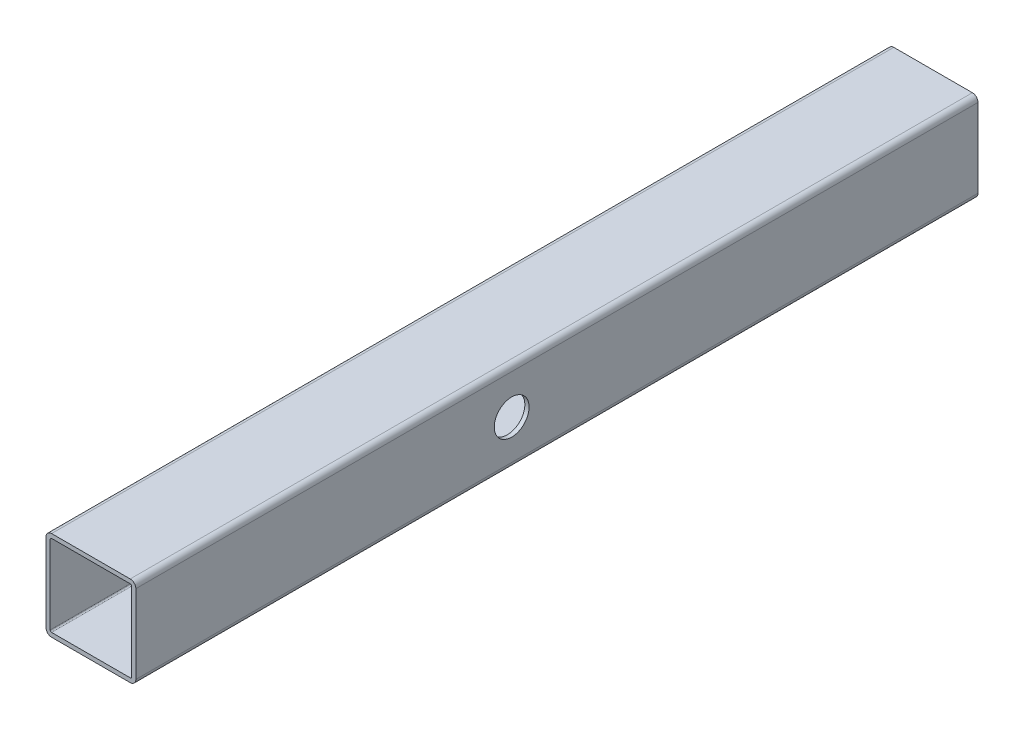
ISO-10303-21;
HEADER;
FILE_DESCRIPTION(('STEP AP214'),'2;1');
FILE_NAME('part.step','',(''),(''),'','','');
FILE_SCHEMA(('AUTOMOTIVE_DESIGN { 1 0 10303 214 1 1 1 1 }'));
ENDSEC;
DATA;
#1=APPLICATION_CONTEXT('core data for automotive mechanical design processes');
#2=APPLICATION_PROTOCOL_DEFINITION('international standard','automotive_design',2000,#1);
#3=PRODUCT_CONTEXT('',#1,'mechanical');
#4=PRODUCT('Part','Part','',(#3));
#5=PRODUCT_RELATED_PRODUCT_CATEGORY('part','',(#4));
#6=PRODUCT_DEFINITION_FORMATION('','',#4);
#7=PRODUCT_DEFINITION_CONTEXT('part definition',#1,'design');
#8=PRODUCT_DEFINITION('design','',#6,#7);
#9=PRODUCT_DEFINITION_SHAPE('','',#8);
#10=(LENGTH_UNIT() NAMED_UNIT(*) SI_UNIT(.MILLI.,.METRE.));
#11=(NAMED_UNIT(*) PLANE_ANGLE_UNIT() SI_UNIT($,.RADIAN.));
#12=(NAMED_UNIT(*) SI_UNIT($,.STERADIAN.) SOLID_ANGLE_UNIT());
#13=UNCERTAINTY_MEASURE_WITH_UNIT(LENGTH_MEASURE(1.E-05),#10,'distance_accuracy_value','');
#14=(GEOMETRIC_REPRESENTATION_CONTEXT(3) GLOBAL_UNCERTAINTY_ASSIGNED_CONTEXT((#13)) GLOBAL_UNIT_ASSIGNED_CONTEXT((#10,
#11,#12)) REPRESENTATION_CONTEXT('',''));
#15=CARTESIAN_POINT('',(0.,0.,0.));
#16=DIRECTION('',(0.,0.,1.));
#17=DIRECTION('',(1.,0.,0.));
#18=AXIS2_PLACEMENT_3D('',#15,#16,#17);
#19=CARTESIAN_POINT('',(-44.4499999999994,44.4499999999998,476.25));
#20=DIRECTION('',(0.,0.,-1.));
#21=DIRECTION('',(-1.,0.,0.));
#22=AXIS2_PLACEMENT_3D('',#19,#20,#21);
#23=PLANE('',#22);
#24=CARTESIAN_POINT('',(-44.4499999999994,44.4499999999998,476.25));
#25=DIRECTION('',(0.,0.,1.));
#26=DIRECTION('',(-1.,0.,0.));
#27=AXIS2_PLACEMENT_3D('',#24,#25,#26);
#28=CIRCLE('',#27,6.35);
#29=CARTESIAN_POINT('',(-44.4499999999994,50.7999999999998,476.25));
#30=VERTEX_POINT('',#29);
#31=CARTESIAN_POINT('',(-50.7999999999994,44.4499999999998,476.249999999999));
#32=VERTEX_POINT('',#31);
#33=EDGE_CURVE('E215',#30,#32,#28,.T.);
#34=ORIENTED_EDGE('',*,*,#33,.T.);
#35=DIRECTION('',(0.,-1.,0.));
#36=VECTOR('',#35,1.);
#37=CARTESIAN_POINT('',(-50.7999999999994,44.4499999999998,476.249999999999));
#38=LINE('',#37,#36);
#39=CARTESIAN_POINT('',(-50.7999999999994,-44.45,476.249999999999));
#40=VERTEX_POINT('',#39);
#41=EDGE_CURVE('E218',#32,#40,#38,.T.);
#42=ORIENTED_EDGE('',*,*,#41,.T.);
#43=CARTESIAN_POINT('',(-44.4499999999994,-44.45,476.249999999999));
#44=DIRECTION('',(0.,0.,1.));
#45=DIRECTION('',(-1.,0.,0.));
#46=AXIS2_PLACEMENT_3D('',#43,#44,#45);
#47=CIRCLE('',#46,6.35);
#48=CARTESIAN_POINT('',(-44.4499999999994,-50.8,476.249999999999));
#49=VERTEX_POINT('',#48);
#50=EDGE_CURVE('E221',#40,#49,#47,.T.);
#51=ORIENTED_EDGE('',*,*,#50,.T.);
#52=DIRECTION('',(1.,0.,0.));
#53=VECTOR('',#52,1.);
#54=CARTESIAN_POINT('',(-44.4499999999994,-50.8,476.249999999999));
#55=LINE('',#54,#53);
#56=CARTESIAN_POINT('',(44.45,-50.8000000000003,476.249999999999));
#57=VERTEX_POINT('',#56);
#58=EDGE_CURVE('E223',#49,#57,#55,.T.);
#59=ORIENTED_EDGE('',*,*,#58,.T.);
#60=CARTESIAN_POINT('',(44.45,-44.4500000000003,476.249999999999));
#61=DIRECTION('',(0.,0.,1.));
#62=DIRECTION('',(1.,0.,0.));
#63=AXIS2_PLACEMENT_3D('',#60,#61,#62);
#64=CIRCLE('',#63,6.35);
#65=CARTESIAN_POINT('',(50.8,-44.4500000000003,476.25));
#66=VERTEX_POINT('',#65);
#67=EDGE_CURVE('E225',#57,#66,#64,.T.);
#68=ORIENTED_EDGE('',*,*,#67,.T.);
#69=DIRECTION('',(0.,1.,0.));
#70=VECTOR('',#69,1.);
#71=CARTESIAN_POINT('',(50.8,44.4499999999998,476.25));
#72=LINE('',#71,#70);
#73=CARTESIAN_POINT('',(50.8,44.4499999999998,476.25));
#74=VERTEX_POINT('',#73);
#75=EDGE_CURVE('E227',#66,#74,#72,.T.);
#76=ORIENTED_EDGE('',*,*,#75,.T.);
#77=CARTESIAN_POINT('',(44.45,44.4499999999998,476.25));
#78=DIRECTION('',(0.,0.,1.));
#79=DIRECTION('',(1.,0.,0.));
#80=AXIS2_PLACEMENT_3D('',#77,#78,#79);
#81=CIRCLE('',#80,6.35);
#82=CARTESIAN_POINT('',(44.45,50.7999999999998,476.25));
#83=VERTEX_POINT('',#82);
#84=EDGE_CURVE('E229',#74,#83,#81,.T.);
#85=ORIENTED_EDGE('',*,*,#84,.T.);
#86=DIRECTION('',(-1.,0.,0.));
#87=VECTOR('',#86,1.);
#88=CARTESIAN_POINT('',(-44.4499999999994,50.7999999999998,476.25));
#89=LINE('',#88,#87);
#90=EDGE_CURVE('E231',#83,#30,#89,.T.);
#91=ORIENTED_EDGE('',*,*,#90,.T.);
#92=EDGE_LOOP('',(#34,#42,#51,#59,#68,#76,#85,#91));
#93=FACE_BOUND('',#92,.T.);
#94=CARTESIAN_POINT('',(-44.4499999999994,44.4499999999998,476.25));
#95=DIRECTION('',(0.,0.,1.));
#96=DIRECTION('',(-1.,0.,0.));
#97=AXIS2_PLACEMENT_3D('',#94,#95,#96);
#98=CIRCLE('',#97,1.5875);
#99=CARTESIAN_POINT('',(-44.4499999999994,46.0374999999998,476.25));
#100=VERTEX_POINT('',#99);
#101=CARTESIAN_POINT('',(-46.0374999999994,44.4499999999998,476.25));
#102=VERTEX_POINT('',#101);
#103=EDGE_CURVE('E148',#100,#102,#98,.T.);
#104=ORIENTED_EDGE('',*,*,#103,.F.);
#105=DIRECTION('',(-1.,0.,0.));
#106=VECTOR('',#105,1.);
#107=CARTESIAN_POINT('',(-44.4499999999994,46.0374999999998,476.25));
#108=LINE('',#107,#106);
#109=CARTESIAN_POINT('',(44.45,46.0374999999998,476.25));
#110=VERTEX_POINT('',#109);
#111=EDGE_CURVE('E182',#110,#100,#108,.T.);
#112=ORIENTED_EDGE('',*,*,#111,.F.);
#113=CARTESIAN_POINT('',(44.45,44.4499999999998,476.25));
#114=DIRECTION('',(0.,0.,1.));
#115=DIRECTION('',(1.,0.,0.));
#116=AXIS2_PLACEMENT_3D('',#113,#114,#115);
#117=CIRCLE('',#116,1.5875);
#118=CARTESIAN_POINT('',(46.0375,44.4499999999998,476.25));
#119=VERTEX_POINT('',#118);
#120=EDGE_CURVE('E180',#119,#110,#117,.T.);
#121=ORIENTED_EDGE('',*,*,#120,.F.);
#122=DIRECTION('',(0.,1.,0.));
#123=VECTOR('',#122,1.);
#124=CARTESIAN_POINT('',(46.0375,44.4499999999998,476.25));
#125=LINE('',#124,#123);
#126=CARTESIAN_POINT('',(46.0375,-44.4500000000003,476.25));
#127=VERTEX_POINT('',#126);
#128=EDGE_CURVE('E178',#127,#119,#125,.T.);
#129=ORIENTED_EDGE('',*,*,#128,.F.);
#130=CARTESIAN_POINT('',(44.45,-44.4500000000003,476.249999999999));
#131=DIRECTION('',(0.,0.,1.));
#132=DIRECTION('',(1.,0.,0.));
#133=AXIS2_PLACEMENT_3D('',#130,#131,#132);
#134=CIRCLE('',#133,1.58749999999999);
#135=CARTESIAN_POINT('',(44.45,-46.0375000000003,476.249999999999));
#136=VERTEX_POINT('',#135);
#137=EDGE_CURVE('E176',#136,#127,#134,.T.);
#138=ORIENTED_EDGE('',*,*,#137,.F.);
#139=DIRECTION('',(1.,0.,0.));
#140=VECTOR('',#139,1.);
#141=CARTESIAN_POINT('',(-44.4499999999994,-46.0375,476.249999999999));
#142=LINE('',#141,#140);
#143=CARTESIAN_POINT('',(-44.4499999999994,-46.0375,476.249999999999));
#144=VERTEX_POINT('',#143);
#145=EDGE_CURVE('E171',#144,#136,#142,.T.);
#146=ORIENTED_EDGE('',*,*,#145,.F.);
#147=CARTESIAN_POINT('',(-44.4499999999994,-44.45,476.249999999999));
#148=DIRECTION('',(0.,0.,1.));
#149=DIRECTION('',(-1.,0.,0.));
#150=AXIS2_PLACEMENT_3D('',#147,#148,#149);
#151=CIRCLE('',#150,1.5875);
#152=CARTESIAN_POINT('',(-46.0374999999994,-44.45,476.25));
#153=VERTEX_POINT('',#152);
#154=EDGE_CURVE('E169',#153,#144,#151,.T.);
#155=ORIENTED_EDGE('',*,*,#154,.F.);
#156=DIRECTION('',(0.,-1.,0.));
#157=VECTOR('',#156,1.);
#158=CARTESIAN_POINT('',(-46.0374999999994,44.4499999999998,476.25));
#159=LINE('',#158,#157);
#160=EDGE_CURVE('E156',#102,#153,#159,.T.);
#161=ORIENTED_EDGE('',*,*,#160,.F.);
#162=EDGE_LOOP('',(#104,#112,#121,#129,#138,#146,#155,#161));
#163=FACE_BOUND('',#162,.T.);
#164=ADVANCED_FACE('F34',(#93,#163),#23,.F.);
#165=CARTESIAN_POINT('',(-44.45,44.4499999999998,-476.25));
#166=DIRECTION('',(0.,0.,-1.));
#167=DIRECTION('',(-1.,0.,0.));
#168=AXIS2_PLACEMENT_3D('',#165,#166,#167);
#169=PLANE('',#168);
#170=CARTESIAN_POINT('',(-44.45,44.4499999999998,-476.25));
#171=DIRECTION('',(0.,0.,1.));
#172=DIRECTION('',(-1.,0.,0.));
#173=AXIS2_PLACEMENT_3D('',#170,#171,#172);
#174=CIRCLE('',#173,6.35);
#175=CARTESIAN_POINT('',(-44.4499999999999,50.7999999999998,-476.25));
#176=VERTEX_POINT('',#175);
#177=CARTESIAN_POINT('',(-50.8,44.4499999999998,-476.250000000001));
#178=VERTEX_POINT('',#177);
#179=EDGE_CURVE('E164',#176,#178,#174,.T.);
#180=ORIENTED_EDGE('',*,*,#179,.F.);
#181=DIRECTION('',(-1.,0.,0.));
#182=VECTOR('',#181,1.);
#183=CARTESIAN_POINT('',(-44.4499999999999,50.7999999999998,-476.25));
#184=LINE('',#183,#182);
#185=CARTESIAN_POINT('',(44.4500000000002,50.7999999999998,-476.25));
#186=VERTEX_POINT('',#185);
#187=EDGE_CURVE('E219',#186,#176,#184,.T.);
#188=ORIENTED_EDGE('',*,*,#187,.F.);
#189=CARTESIAN_POINT('',(44.4500000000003,44.4499999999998,-476.25));
#190=DIRECTION('',(0.,0.,1.));
#191=DIRECTION('',(1.,0.,0.));
#192=AXIS2_PLACEMENT_3D('',#189,#190,#191);
#193=CIRCLE('',#192,6.35);
#194=CARTESIAN_POINT('',(50.8000000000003,44.4499999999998,-476.25));
#195=VERTEX_POINT('',#194);
#196=EDGE_CURVE('E246',#195,#186,#193,.T.);
#197=ORIENTED_EDGE('',*,*,#196,.F.);
#198=DIRECTION('',(0.,1.,0.));
#199=VECTOR('',#198,1.);
#200=CARTESIAN_POINT('',(50.8000000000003,44.4499999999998,-476.25));
#201=LINE('',#200,#199);
#202=CARTESIAN_POINT('',(50.8000000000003,-44.4500000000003,-476.25));
#203=VERTEX_POINT('',#202);
#204=EDGE_CURVE('E244',#203,#195,#201,.T.);
#205=ORIENTED_EDGE('',*,*,#204,.F.);
#206=CARTESIAN_POINT('',(44.4500000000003,-44.4500000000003,-476.250000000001));
#207=DIRECTION('',(0.,0.,1.));
#208=DIRECTION('',(1.,0.,0.));
#209=AXIS2_PLACEMENT_3D('',#206,#207,#208);
#210=CIRCLE('',#209,6.35);
#211=CARTESIAN_POINT('',(44.4500000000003,-50.8000000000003,-476.250000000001));
#212=VERTEX_POINT('',#211);
#213=EDGE_CURVE('E242',#212,#203,#210,.T.);
#214=ORIENTED_EDGE('',*,*,#213,.F.);
#215=DIRECTION('',(1.,0.,0.));
#216=VECTOR('',#215,1.);
#217=CARTESIAN_POINT('',(-44.4499999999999,-50.8,-476.250000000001));
#218=LINE('',#217,#216);
#219=CARTESIAN_POINT('',(-44.4499999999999,-50.8,-476.250000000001));
#220=VERTEX_POINT('',#219);
#221=EDGE_CURVE('E240',#220,#212,#218,.T.);
#222=ORIENTED_EDGE('',*,*,#221,.F.);
#223=CARTESIAN_POINT('',(-44.45,-44.45,-476.250000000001));
#224=DIRECTION('',(0.,0.,1.));
#225=DIRECTION('',(-1.,0.,0.));
#226=AXIS2_PLACEMENT_3D('',#223,#224,#225);
#227=CIRCLE('',#226,6.35);
#228=CARTESIAN_POINT('',(-50.8,-44.45,-476.250000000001));
#229=VERTEX_POINT('',#228);
#230=EDGE_CURVE('E238',#229,#220,#227,.T.);
#231=ORIENTED_EDGE('',*,*,#230,.F.);
#232=DIRECTION('',(0.,-1.,0.));
#233=VECTOR('',#232,1.);
#234=CARTESIAN_POINT('',(-50.8,44.4499999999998,-476.250000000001));
#235=LINE('',#234,#233);
#236=EDGE_CURVE('E236',#178,#229,#235,.T.);
#237=ORIENTED_EDGE('',*,*,#236,.F.);
#238=EDGE_LOOP('',(#180,#188,#197,#205,#214,#222,#231,#237));
#239=FACE_BOUND('',#238,.T.);
#240=DIRECTION('',(-1.,0.,0.));
#241=VECTOR('',#240,1.);
#242=CARTESIAN_POINT('',(-44.4499999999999,46.0374999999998,-476.25));
#243=LINE('',#242,#241);
#244=CARTESIAN_POINT('',(44.4500000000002,46.0374999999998,-476.25));
#245=VERTEX_POINT('',#244);
#246=CARTESIAN_POINT('',(-44.4499999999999,46.0374999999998,-476.25));
#247=VERTEX_POINT('',#246);
#248=EDGE_CURVE('E157',#245,#247,#243,.T.);
#249=ORIENTED_EDGE('',*,*,#248,.T.);
#250=CARTESIAN_POINT('',(-44.45,44.4499999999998,-476.25));
#251=DIRECTION('',(0.,0.,1.));
#252=DIRECTION('',(-1.,0.,0.));
#253=AXIS2_PLACEMENT_3D('',#250,#251,#252);
#254=CIRCLE('',#253,1.5875);
#255=CARTESIAN_POINT('',(-46.0375,44.4499999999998,-476.25));
#256=VERTEX_POINT('',#255);
#257=EDGE_CURVE('E58',#247,#256,#254,.T.);
#258=ORIENTED_EDGE('',*,*,#257,.T.);
#259=DIRECTION('',(0.,-1.,0.));
#260=VECTOR('',#259,1.);
#261=CARTESIAN_POINT('',(-46.0375,44.4499999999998,-476.25));
#262=LINE('',#261,#260);
#263=CARTESIAN_POINT('',(-46.0375,-44.45,-476.25));
#264=VERTEX_POINT('',#263);
#265=EDGE_CURVE('E163',#256,#264,#262,.T.);
#266=ORIENTED_EDGE('',*,*,#265,.T.);
#267=CARTESIAN_POINT('',(-44.45,-44.45,-476.250000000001));
#268=DIRECTION('',(0.,0.,1.));
#269=DIRECTION('',(-1.,0.,0.));
#270=AXIS2_PLACEMENT_3D('',#267,#268,#269);
#271=CIRCLE('',#270,1.5875);
#272=CARTESIAN_POINT('',(-44.4499999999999,-46.0375,-476.250000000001));
#273=VERTEX_POINT('',#272);
#274=EDGE_CURVE('E187',#264,#273,#271,.T.);
#275=ORIENTED_EDGE('',*,*,#274,.T.);
#276=DIRECTION('',(1.,0.,0.));
#277=VECTOR('',#276,1.);
#278=CARTESIAN_POINT('',(-44.4499999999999,-46.0375,-476.250000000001));
#279=LINE('',#278,#277);
#280=CARTESIAN_POINT('',(44.4500000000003,-46.0375000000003,-476.250000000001));
#281=VERTEX_POINT('',#280);
#282=EDGE_CURVE('E190',#273,#281,#279,.T.);
#283=ORIENTED_EDGE('',*,*,#282,.T.);
#284=CARTESIAN_POINT('',(44.4500000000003,-44.4500000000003,-476.250000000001));
#285=DIRECTION('',(0.,0.,1.));
#286=DIRECTION('',(1.,0.,0.));
#287=AXIS2_PLACEMENT_3D('',#284,#285,#286);
#288=CIRCLE('',#287,1.58749999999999);
#289=CARTESIAN_POINT('',(46.0375000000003,-44.4500000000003,-476.25));
#290=VERTEX_POINT('',#289);
#291=EDGE_CURVE('E193',#281,#290,#288,.T.);
#292=ORIENTED_EDGE('',*,*,#291,.T.);
#293=DIRECTION('',(0.,1.,0.));
#294=VECTOR('',#293,1.);
#295=CARTESIAN_POINT('',(46.0375000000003,44.4499999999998,-476.25));
#296=LINE('',#295,#294);
#297=CARTESIAN_POINT('',(46.0375000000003,44.4499999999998,-476.25));
#298=VERTEX_POINT('',#297);
#299=EDGE_CURVE('E196',#290,#298,#296,.T.);
#300=ORIENTED_EDGE('',*,*,#299,.T.);
#301=CARTESIAN_POINT('',(44.4500000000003,44.4499999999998,-476.25));
#302=DIRECTION('',(0.,0.,1.));
#303=DIRECTION('',(1.,0.,0.));
#304=AXIS2_PLACEMENT_3D('',#301,#302,#303);
#305=CIRCLE('',#304,1.5875);
#306=EDGE_CURVE('E199',#298,#245,#305,.T.);
#307=ORIENTED_EDGE('',*,*,#306,.T.);
#308=EDGE_LOOP('',(#249,#258,#266,#275,#283,#292,#300,#307));
#309=FACE_BOUND('',#308,.T.);
#310=ADVANCED_FACE('F277',(#239,#309),#169,.T.);
#311=CARTESIAN_POINT('',(-44.4499999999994,44.4499999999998,476.25));
#312=DIRECTION('',(0.,0.,-1.));
#313=DIRECTION('',(-1.,0.,0.));
#314=AXIS2_PLACEMENT_3D('',#311,#312,#313);
#315=CYLINDRICAL_SURFACE('',#314,6.35);
#316=ORIENTED_EDGE('',*,*,#179,.T.);
#317=DIRECTION('',(0.,0.,-1.));
#318=VECTOR('',#317,1.);
#319=CARTESIAN_POINT('',(-50.7999999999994,44.4499999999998,476.249999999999));
#320=LINE('',#319,#318);
#321=EDGE_CURVE('E11',#32,#178,#320,.T.);
#322=ORIENTED_EDGE('',*,*,#321,.F.);
#323=ORIENTED_EDGE('',*,*,#33,.F.);
#324=DIRECTION('',(0.,0.,-1.));
#325=VECTOR('',#324,1.);
#326=CARTESIAN_POINT('',(-44.4499999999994,50.7999999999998,476.25));
#327=LINE('',#326,#325);
#328=EDGE_CURVE('E233',#30,#176,#327,.T.);
#329=ORIENTED_EDGE('',*,*,#328,.T.);
#330=EDGE_LOOP('',(#316,#322,#323,#329));
#331=FACE_BOUND('',#330,.T.);
#332=ADVANCED_FACE('F36',(#331),#315,.T.);
#333=CARTESIAN_POINT('',(-50.7999999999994,44.4499999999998,476.249999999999));
#334=DIRECTION('',(1.,0.,0.));
#335=DIRECTION('',(0.,1.,0.));
#336=AXIS2_PLACEMENT_3D('',#333,#334,#335);
#337=PLANE('',#336);
#338=CARTESIAN_POINT('',(-50.8,0.,51.1809999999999));
#339=DIRECTION('',(-1.,0.,0.));
#340=DIRECTION('',(0.,-1.,0.));
#341=AXIS2_PLACEMENT_3D('',#338,#339,#340);
#342=CIRCLE('',#341,19.685);
#343=CARTESIAN_POINT('',(-50.8,-19.6850000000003,51.181));
#344=VERTEX_POINT('',#343);
#345=EDGE_CURVE('E375',#344,#344,#342,.T.);
#346=ORIENTED_EDGE('',*,*,#345,.F.);
#347=EDGE_LOOP('',(#346));
#348=FACE_BOUND('',#347,.T.);
#349=ORIENTED_EDGE('',*,*,#236,.T.);
#350=DIRECTION('',(0.,0.,-1.));
#351=VECTOR('',#350,1.);
#352=CARTESIAN_POINT('',(-50.7999999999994,-44.45,476.249999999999));
#353=LINE('',#352,#351);
#354=EDGE_CURVE('E43',#40,#229,#353,.T.);
#355=ORIENTED_EDGE('',*,*,#354,.F.);
#356=ORIENTED_EDGE('',*,*,#41,.F.);
#357=ORIENTED_EDGE('',*,*,#321,.T.);
#358=EDGE_LOOP('',(#349,#355,#356,#357));
#359=FACE_BOUND('',#358,.T.);
#360=ADVANCED_FACE('F294',(#348,#359),#337,.F.);
#361=CARTESIAN_POINT('',(-44.4499999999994,-44.45,476.249999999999));
#362=DIRECTION('',(0.,0.,-1.));
#363=DIRECTION('',(-1.,0.,0.));
#364=AXIS2_PLACEMENT_3D('',#361,#362,#363);
#365=CYLINDRICAL_SURFACE('',#364,6.35);
#366=ORIENTED_EDGE('',*,*,#230,.T.);
#367=DIRECTION('',(0.,0.,-1.));
#368=VECTOR('',#367,1.);
#369=CARTESIAN_POINT('',(-44.4499999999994,-50.8,476.249999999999));
#370=LINE('',#369,#368);
#371=EDGE_CURVE('E263',#49,#220,#370,.T.);
#372=ORIENTED_EDGE('',*,*,#371,.F.);
#373=ORIENTED_EDGE('',*,*,#50,.F.);
#374=ORIENTED_EDGE('',*,*,#354,.T.);
#375=EDGE_LOOP('',(#366,#372,#373,#374));
#376=FACE_BOUND('',#375,.T.);
#377=ADVANCED_FACE('F271',(#376),#365,.T.);
#378=CARTESIAN_POINT('',(-44.4499999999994,-50.8,476.249999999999));
#379=DIRECTION('',(0.,1.,0.));
#380=DIRECTION('',(0.,0.,1.));
#381=AXIS2_PLACEMENT_3D('',#378,#379,#380);
#382=PLANE('',#381);
#383=ORIENTED_EDGE('',*,*,#221,.T.);
#384=DIRECTION('',(0.,0.,-1.));
#385=VECTOR('',#384,1.);
#386=CARTESIAN_POINT('',(44.45,-50.8000000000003,476.249999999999));
#387=LINE('',#386,#385);
#388=EDGE_CURVE('E260',#57,#212,#387,.T.);
#389=ORIENTED_EDGE('',*,*,#388,.F.);
#390=ORIENTED_EDGE('',*,*,#58,.F.);
#391=ORIENTED_EDGE('',*,*,#371,.T.);
#392=EDGE_LOOP('',(#383,#389,#390,#391));
#393=FACE_BOUND('',#392,.T.);
#394=ADVANCED_FACE('F283',(#393),#382,.F.);
#395=CARTESIAN_POINT('',(44.45,-44.4500000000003,476.249999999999));
#396=DIRECTION('',(0.,0.,-1.));
#397=DIRECTION('',(-1.,0.,0.));
#398=AXIS2_PLACEMENT_3D('',#395,#396,#397);
#399=CYLINDRICAL_SURFACE('',#398,6.35);
#400=ORIENTED_EDGE('',*,*,#213,.T.);
#401=DIRECTION('',(0.,0.,-1.));
#402=VECTOR('',#401,1.);
#403=CARTESIAN_POINT('',(50.8,-44.4500000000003,476.25));
#404=LINE('',#403,#402);
#405=EDGE_CURVE('E257',#66,#203,#404,.T.);
#406=ORIENTED_EDGE('',*,*,#405,.F.);
#407=ORIENTED_EDGE('',*,*,#67,.F.);
#408=ORIENTED_EDGE('',*,*,#388,.T.);
#409=EDGE_LOOP('',(#400,#406,#407,#408));
#410=FACE_BOUND('',#409,.T.);
#411=ADVANCED_FACE('F287',(#410),#399,.T.);
#412=CARTESIAN_POINT('',(50.8,44.4499999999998,476.25));
#413=DIRECTION('',(-1.,0.,0.));
#414=DIRECTION('',(0.,-1.,0.));
#415=AXIS2_PLACEMENT_3D('',#412,#413,#414);
#416=PLANE('',#415);
#417=CARTESIAN_POINT('',(50.8000000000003,-3.05311331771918E-13,51.181));
#418=DIRECTION('',(-1.,0.,0.));
#419=DIRECTION('',(0.,-1.,0.));
#420=AXIS2_PLACEMENT_3D('',#417,#418,#419);
#421=CIRCLE('',#420,19.685);
#422=CARTESIAN_POINT('',(50.8000000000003,-19.6850000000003,51.181));
#423=VERTEX_POINT('',#422);
#424=EDGE_CURVE('E374',#423,#423,#421,.T.);
#425=ORIENTED_EDGE('',*,*,#424,.T.);
#426=EDGE_LOOP('',(#425));
#427=FACE_BOUND('',#426,.T.);
#428=ORIENTED_EDGE('',*,*,#204,.T.);
#429=DIRECTION('',(0.,0.,-1.));
#430=VECTOR('',#429,1.);
#431=CARTESIAN_POINT('',(50.8,44.4499999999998,476.25));
#432=LINE('',#431,#430);
#433=EDGE_CURVE('E254',#74,#195,#432,.T.);
#434=ORIENTED_EDGE('',*,*,#433,.F.);
#435=ORIENTED_EDGE('',*,*,#75,.F.);
#436=ORIENTED_EDGE('',*,*,#405,.T.);
#437=EDGE_LOOP('',(#428,#434,#435,#436));
#438=FACE_BOUND('',#437,.T.);
#439=ADVANCED_FACE('F307',(#427,#438),#416,.F.);
#440=CARTESIAN_POINT('',(44.45,44.4499999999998,476.25));
#441=DIRECTION('',(0.,0.,-1.));
#442=DIRECTION('',(-1.,0.,0.));
#443=AXIS2_PLACEMENT_3D('',#440,#441,#442);
#444=CYLINDRICAL_SURFACE('',#443,6.35);
#445=ORIENTED_EDGE('',*,*,#196,.T.);
#446=DIRECTION('',(0.,0.,-1.));
#447=VECTOR('',#446,1.);
#448=CARTESIAN_POINT('',(44.45,50.7999999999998,476.25));
#449=LINE('',#448,#447);
#450=EDGE_CURVE('E251',#83,#186,#449,.T.);
#451=ORIENTED_EDGE('',*,*,#450,.F.);
#452=ORIENTED_EDGE('',*,*,#84,.F.);
#453=ORIENTED_EDGE('',*,*,#433,.T.);
#454=EDGE_LOOP('',(#445,#451,#452,#453));
#455=FACE_BOUND('',#454,.T.);
#456=ADVANCED_FACE('F305',(#455),#444,.T.);
#457=CARTESIAN_POINT('',(-44.4499999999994,50.7999999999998,476.25));
#458=DIRECTION('',(0.,-1.,0.));
#459=DIRECTION('',(0.,0.,-1.));
#460=AXIS2_PLACEMENT_3D('',#457,#458,#459);
#461=PLANE('',#460);
#462=ORIENTED_EDGE('',*,*,#187,.T.);
#463=ORIENTED_EDGE('',*,*,#328,.F.);
#464=ORIENTED_EDGE('',*,*,#90,.F.);
#465=ORIENTED_EDGE('',*,*,#450,.T.);
#466=EDGE_LOOP('',(#462,#463,#464,#465));
#467=FACE_BOUND('',#466,.T.);
#468=ADVANCED_FACE('F300',(#467),#461,.F.);
#469=CARTESIAN_POINT('',(-44.4499999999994,44.4499999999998,476.25));
#470=DIRECTION('',(0.,0.,-1.));
#471=DIRECTION('',(-1.,0.,0.));
#472=AXIS2_PLACEMENT_3D('',#469,#470,#471);
#473=CYLINDRICAL_SURFACE('',#472,1.5875);
#474=ORIENTED_EDGE('',*,*,#257,.F.);
#475=DIRECTION('',(0.,0.,-1.));
#476=VECTOR('',#475,1.);
#477=CARTESIAN_POINT('',(-44.4499999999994,46.0374999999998,476.25));
#478=LINE('',#477,#476);
#479=EDGE_CURVE('E152',#100,#247,#478,.T.);
#480=ORIENTED_EDGE('',*,*,#479,.F.);
#481=ORIENTED_EDGE('',*,*,#103,.T.);
#482=DIRECTION('',(0.,0.,-1.));
#483=VECTOR('',#482,1.);
#484=CARTESIAN_POINT('',(-46.0374999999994,44.4499999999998,476.25));
#485=LINE('',#484,#483);
#486=EDGE_CURVE('E151',#102,#256,#485,.T.);
#487=ORIENTED_EDGE('',*,*,#486,.T.);
#488=EDGE_LOOP('',(#474,#480,#481,#487));
#489=FACE_BOUND('',#488,.T.);
#490=ADVANCED_FACE('F150',(#489),#473,.F.);
#491=CARTESIAN_POINT('',(-46.0374999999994,44.4499999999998,476.25));
#492=DIRECTION('',(1.,0.,0.));
#493=DIRECTION('',(0.,1.,0.));
#494=AXIS2_PLACEMENT_3D('',#491,#492,#493);
#495=PLANE('',#494);
#496=CARTESIAN_POINT('',(-46.0375,0.,51.181));
#497=DIRECTION('',(1.,0.,0.));
#498=DIRECTION('',(0.,1.,0.));
#499=AXIS2_PLACEMENT_3D('',#496,#497,#498);
#500=CIRCLE('',#499,19.685);
#501=CARTESIAN_POINT('',(-46.0375,-19.6850000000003,51.181));
#502=VERTEX_POINT('',#501);
#503=EDGE_CURVE('E185',#502,#502,#500,.T.);
#504=ORIENTED_EDGE('',*,*,#503,.F.);
#505=EDGE_LOOP('',(#504));
#506=FACE_BOUND('',#505,.T.);
#507=ORIENTED_EDGE('',*,*,#265,.F.);
#508=ORIENTED_EDGE('',*,*,#486,.F.);
#509=ORIENTED_EDGE('',*,*,#160,.T.);
#510=DIRECTION('',(0.,0.,-1.));
#511=VECTOR('',#510,1.);
#512=CARTESIAN_POINT('',(-46.0374999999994,-44.45,476.25));
#513=LINE('',#512,#511);
#514=EDGE_CURVE('E165',#153,#264,#513,.T.);
#515=ORIENTED_EDGE('',*,*,#514,.T.);
#516=EDGE_LOOP('',(#507,#508,#509,#515));
#517=FACE_BOUND('',#516,.T.);
#518=ADVANCED_FACE('F160',(#506,#517),#495,.T.);
#519=CARTESIAN_POINT('',(-44.4499999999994,-44.45,476.249999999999));
#520=DIRECTION('',(0.,0.,-1.));
#521=DIRECTION('',(-1.,0.,0.));
#522=AXIS2_PLACEMENT_3D('',#519,#520,#521);
#523=CYLINDRICAL_SURFACE('',#522,1.5875);
#524=ORIENTED_EDGE('',*,*,#274,.F.);
#525=ORIENTED_EDGE('',*,*,#514,.F.);
#526=ORIENTED_EDGE('',*,*,#154,.T.);
#527=DIRECTION('',(0.,0.,-1.));
#528=VECTOR('',#527,1.);
#529=CARTESIAN_POINT('',(-44.4499999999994,-46.0375,476.249999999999));
#530=LINE('',#529,#528);
#531=EDGE_CURVE('E212',#144,#273,#530,.T.);
#532=ORIENTED_EDGE('',*,*,#531,.T.);
#533=EDGE_LOOP('',(#524,#525,#526,#532));
#534=FACE_BOUND('',#533,.T.);
#535=ADVANCED_FACE('F334',(#534),#523,.F.);
#536=CARTESIAN_POINT('',(-44.4499999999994,-46.0375,476.249999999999));
#537=DIRECTION('',(0.,1.,0.));
#538=DIRECTION('',(0.,0.,1.));
#539=AXIS2_PLACEMENT_3D('',#536,#537,#538);
#540=PLANE('',#539);
#541=ORIENTED_EDGE('',*,*,#282,.F.);
#542=ORIENTED_EDGE('',*,*,#531,.F.);
#543=ORIENTED_EDGE('',*,*,#145,.T.);
#544=DIRECTION('',(0.,0.,-1.));
#545=VECTOR('',#544,1.);
#546=CARTESIAN_POINT('',(44.45,-46.0375000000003,476.249999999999));
#547=LINE('',#546,#545);
#548=EDGE_CURVE('E210',#136,#281,#547,.T.);
#549=ORIENTED_EDGE('',*,*,#548,.T.);
#550=EDGE_LOOP('',(#541,#542,#543,#549));
#551=FACE_BOUND('',#550,.T.);
#552=ADVANCED_FACE('F339',(#551),#540,.T.);
#553=CARTESIAN_POINT('',(44.45,-44.4500000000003,476.249999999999));
#554=DIRECTION('',(0.,0.,-1.));
#555=DIRECTION('',(-1.,0.,0.));
#556=AXIS2_PLACEMENT_3D('',#553,#554,#555);
#557=CYLINDRICAL_SURFACE('',#556,1.58749999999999);
#558=ORIENTED_EDGE('',*,*,#291,.F.);
#559=ORIENTED_EDGE('',*,*,#548,.F.);
#560=ORIENTED_EDGE('',*,*,#137,.T.);
#561=DIRECTION('',(0.,0.,-1.));
#562=VECTOR('',#561,1.);
#563=CARTESIAN_POINT('',(46.0375,-44.4500000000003,476.25));
#564=LINE('',#563,#562);
#565=EDGE_CURVE('E208',#127,#290,#564,.T.);
#566=ORIENTED_EDGE('',*,*,#565,.T.);
#567=EDGE_LOOP('',(#558,#559,#560,#566));
#568=FACE_BOUND('',#567,.T.);
#569=ADVANCED_FACE('F346',(#568),#557,.F.);
#570=CARTESIAN_POINT('',(46.0375,44.4499999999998,476.25));
#571=DIRECTION('',(-1.,0.,0.));
#572=DIRECTION('',(0.,0.,1.));
#573=AXIS2_PLACEMENT_3D('',#570,#571,#572);
#574=PLANE('',#573);
#575=CARTESIAN_POINT('',(46.0375000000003,-3.05311331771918E-13,51.1809999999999));
#576=DIRECTION('',(-1.,0.,0.));
#577=DIRECTION('',(0.,0.,1.));
#578=AXIS2_PLACEMENT_3D('',#575,#576,#577);
#579=CIRCLE('',#578,19.685);
#580=CARTESIAN_POINT('',(46.0375000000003,-19.6850000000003,51.181));
#581=VERTEX_POINT('',#580);
#582=EDGE_CURVE('E38',#581,#581,#579,.T.);
#583=ORIENTED_EDGE('',*,*,#582,.F.);
#584=EDGE_LOOP('',(#583));
#585=FACE_BOUND('',#584,.T.);
#586=ORIENTED_EDGE('',*,*,#299,.F.);
#587=ORIENTED_EDGE('',*,*,#565,.F.);
#588=ORIENTED_EDGE('',*,*,#128,.T.);
#589=DIRECTION('',(0.,0.,-1.));
#590=VECTOR('',#589,1.);
#591=CARTESIAN_POINT('',(46.0375,44.4499999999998,476.25));
#592=LINE('',#591,#590);
#593=EDGE_CURVE('E206',#119,#298,#592,.T.);
#594=ORIENTED_EDGE('',*,*,#593,.T.);
#595=EDGE_LOOP('',(#586,#587,#588,#594));
#596=FACE_BOUND('',#595,.T.);
#597=ADVANCED_FACE('F350',(#585,#596),#574,.T.);
#598=CARTESIAN_POINT('',(44.45,44.4499999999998,476.25));
#599=DIRECTION('',(0.,0.,-1.));
#600=DIRECTION('',(-1.,0.,0.));
#601=AXIS2_PLACEMENT_3D('',#598,#599,#600);
#602=CYLINDRICAL_SURFACE('',#601,1.5875);
#603=ORIENTED_EDGE('',*,*,#306,.F.);
#604=ORIENTED_EDGE('',*,*,#593,.F.);
#605=ORIENTED_EDGE('',*,*,#120,.T.);
#606=DIRECTION('',(0.,0.,-1.));
#607=VECTOR('',#606,1.);
#608=CARTESIAN_POINT('',(44.45,46.0374999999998,476.25));
#609=LINE('',#608,#607);
#610=EDGE_CURVE('E50',#110,#245,#609,.T.);
#611=ORIENTED_EDGE('',*,*,#610,.T.);
#612=EDGE_LOOP('',(#603,#604,#605,#611));
#613=FACE_BOUND('',#612,.T.);
#614=ADVANCED_FACE('F354',(#613),#602,.F.);
#615=CARTESIAN_POINT('',(-44.4499999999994,46.0374999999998,476.25));
#616=DIRECTION('',(0.,-1.,0.));
#617=DIRECTION('',(0.,0.,-1.));
#618=AXIS2_PLACEMENT_3D('',#615,#616,#617);
#619=PLANE('',#618);
#620=ORIENTED_EDGE('',*,*,#248,.F.);
#621=ORIENTED_EDGE('',*,*,#610,.F.);
#622=ORIENTED_EDGE('',*,*,#111,.T.);
#623=ORIENTED_EDGE('',*,*,#479,.T.);
#624=EDGE_LOOP('',(#620,#621,#622,#623));
#625=FACE_BOUND('',#624,.T.);
#626=ADVANCED_FACE('F358',(#625),#619,.T.);
#627=CARTESIAN_POINT('',(50.8000000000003,-3.05311331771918E-13,51.181));
#628=DIRECTION('',(-1.,0.,0.));
#629=DIRECTION('',(0.,-1.,0.));
#630=AXIS2_PLACEMENT_3D('',#627,#628,#629);
#631=CYLINDRICAL_SURFACE('',#630,19.685);
#632=CARTESIAN_POINT('',(46.0375000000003,-19.6850000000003,51.181));
#633=CARTESIAN_POINT('',(46.0871093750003,-19.6850000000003,51.181));
#634=CARTESIAN_POINT('',(46.1367187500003,-19.6850000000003,51.181));
#635=CARTESIAN_POINT('',(46.2359375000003,-19.6850000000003,51.181));
#636=CARTESIAN_POINT('',(46.2855468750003,-19.6850000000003,51.181));
#637=CARTESIAN_POINT('',(46.3847656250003,-19.6850000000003,51.181));
#638=CARTESIAN_POINT('',(46.4343750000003,-19.6850000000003,51.181));
#639=CARTESIAN_POINT('',(46.5335937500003,-19.6850000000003,51.181));
#640=CARTESIAN_POINT('',(46.5832031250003,-19.6850000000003,51.181));
#641=CARTESIAN_POINT('',(46.6824218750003,-19.6850000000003,51.181));
#642=CARTESIAN_POINT('',(46.7320312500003,-19.6850000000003,51.181));
#643=CARTESIAN_POINT('',(46.8312500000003,-19.6850000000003,51.181));
#644=CARTESIAN_POINT('',(46.8808593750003,-19.6850000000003,51.181));
#645=CARTESIAN_POINT('',(46.9800781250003,-19.6850000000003,51.181));
#646=CARTESIAN_POINT('',(47.0296875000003,-19.6850000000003,51.181));
#647=CARTESIAN_POINT('',(47.1289062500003,-19.6850000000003,51.181));
#648=CARTESIAN_POINT('',(47.1785156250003,-19.6850000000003,51.181));
#649=CARTESIAN_POINT('',(47.2777343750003,-19.6850000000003,51.181));
#650=CARTESIAN_POINT('',(47.3273437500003,-19.6850000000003,51.181));
#651=CARTESIAN_POINT('',(47.4265625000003,-19.6850000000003,51.181));
#652=CARTESIAN_POINT('',(47.4761718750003,-19.6850000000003,51.181));
#653=CARTESIAN_POINT('',(47.5753906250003,-19.6850000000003,51.181));
#654=CARTESIAN_POINT('',(47.6250000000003,-19.6850000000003,51.181));
#655=CARTESIAN_POINT('',(47.7242187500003,-19.6850000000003,51.181));
#656=CARTESIAN_POINT('',(47.7738281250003,-19.6850000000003,51.181));
#657=CARTESIAN_POINT('',(47.8730468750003,-19.6850000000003,51.181));
#658=CARTESIAN_POINT('',(47.9226562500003,-19.6850000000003,51.181));
#659=CARTESIAN_POINT('',(48.0218750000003,-19.6850000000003,51.181));
#660=CARTESIAN_POINT('',(48.0714843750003,-19.6850000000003,51.181));
#661=CARTESIAN_POINT('',(48.1707031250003,-19.6850000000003,51.181));
#662=CARTESIAN_POINT('',(48.2203125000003,-19.6850000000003,51.181));
#663=CARTESIAN_POINT('',(48.3195312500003,-19.6850000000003,51.181));
#664=CARTESIAN_POINT('',(48.3691406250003,-19.6850000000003,51.181));
#665=CARTESIAN_POINT('',(48.4683593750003,-19.6850000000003,51.181));
#666=CARTESIAN_POINT('',(48.5179687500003,-19.6850000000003,51.181));
#667=CARTESIAN_POINT('',(48.6171875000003,-19.6850000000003,51.181));
#668=CARTESIAN_POINT('',(48.6667968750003,-19.6850000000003,51.181));
#669=CARTESIAN_POINT('',(48.7660156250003,-19.6850000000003,51.181));
#670=CARTESIAN_POINT('',(48.8156250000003,-19.6850000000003,51.181));
#671=CARTESIAN_POINT('',(48.9148437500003,-19.6850000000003,51.181));
#672=CARTESIAN_POINT('',(48.9644531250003,-19.6850000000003,51.181));
#673=CARTESIAN_POINT('',(49.0636718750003,-19.6850000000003,51.181));
#674=CARTESIAN_POINT('',(49.1132812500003,-19.6850000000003,51.181));
#675=CARTESIAN_POINT('',(49.2125000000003,-19.6850000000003,51.181));
#676=CARTESIAN_POINT('',(49.2621093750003,-19.6850000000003,51.181));
#677=CARTESIAN_POINT('',(49.3613281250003,-19.6850000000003,51.181));
#678=CARTESIAN_POINT('',(49.4109375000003,-19.6850000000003,51.181));
#679=CARTESIAN_POINT('',(49.5101562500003,-19.6850000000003,51.181));
#680=CARTESIAN_POINT('',(49.5597656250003,-19.6850000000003,51.181));
#681=CARTESIAN_POINT('',(49.6589843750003,-19.6850000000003,51.181));
#682=CARTESIAN_POINT('',(49.7085937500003,-19.6850000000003,51.181));
#683=CARTESIAN_POINT('',(49.8078125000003,-19.6850000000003,51.181));
#684=CARTESIAN_POINT('',(49.8574218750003,-19.6850000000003,51.181));
#685=CARTESIAN_POINT('',(49.9566406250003,-19.6850000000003,51.181));
#686=CARTESIAN_POINT('',(50.0062500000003,-19.6850000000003,51.181));
#687=CARTESIAN_POINT('',(50.1054687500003,-19.6850000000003,51.181));
#688=CARTESIAN_POINT('',(50.1550781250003,-19.6850000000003,51.181));
#689=CARTESIAN_POINT('',(50.2542968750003,-19.6850000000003,51.181));
#690=CARTESIAN_POINT('',(50.3039062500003,-19.6850000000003,51.181));
#691=CARTESIAN_POINT('',(50.4031250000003,-19.6850000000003,51.181));
#692=CARTESIAN_POINT('',(50.4527343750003,-19.6850000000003,51.181));
#693=CARTESIAN_POINT('',(50.5519531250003,-19.6850000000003,51.181));
#694=CARTESIAN_POINT('',(50.6015625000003,-19.6850000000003,51.181));
#695=CARTESIAN_POINT('',(50.7007812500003,-19.6850000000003,51.181));
#696=CARTESIAN_POINT('',(50.7503906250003,-19.6850000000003,51.181));
#697=CARTESIAN_POINT('',(50.8000000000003,-19.6850000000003,51.181));
#698=B_SPLINE_CURVE_WITH_KNOTS('',3,(#632,#633,#634,#635,#636,#637,#638,#639,#640,#641,#642,
#643,#644,#645,#646,#647,#648,#649,#650,#651,#652,#653,#654,#655,#656,#657,#658,#659,#660,#661,
#662,#663,#664,#665,#666,#667,#668,#669,#670,#671,#672,#673,#674,#675,#676,#677,#678,#679,#680,
#681,#682,#683,#684,#685,#686,#687,#688,#689,#690,#691,#692,#693,#694,#695,#696,#697),
.UNSPECIFIED.,.F.,.F.,(4,2,2,2,2,2,2,2,2,2,2,2,2,2,2,2,2,2,2,2,2,2,2,2,2,2,2,2,2,2,2,2,4),(0.,
0.148828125,0.29765625,0.446484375,0.5953125,0.744140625,0.892968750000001,1.041796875,
1.19062500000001,1.33945312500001,1.48828125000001,1.63710937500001,1.78593750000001,
1.93476562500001,2.08359375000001,2.23242187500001,2.38125000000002,2.53007812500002,
2.67890625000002,2.82773437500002,2.97656250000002,3.12539062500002,3.27421875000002,
3.42304687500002,3.57187500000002,3.72070312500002,3.86953125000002,4.01835937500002,
4.16718750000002,4.31601562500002,4.46484375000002,4.61367187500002,4.76250000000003),.UNSPECIFIED.);
#699=EDGE_CURVE('BSEAM362',#581,#423,#698,.T.);
#700=ORIENTED_EDGE('',*,*,#582,.T.);
#701=ORIENTED_EDGE('',*,*,#424,.F.);
#702=ORIENTED_EDGE('',*,*,#699,.T.);
#703=ORIENTED_EDGE('',*,*,#699,.F.);
#704=EDGE_LOOP('',(#700,#702,#701,#703));
#705=FACE_BOUND('',#704,.T.);
#706=ADVANCED_FACE('F362',(#705),#631,.F.);
#707=CARTESIAN_POINT('',(-46.0375,-19.6850000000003,51.181));
#708=CARTESIAN_POINT('',(-46.087109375,-19.6850000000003,51.181));
#709=CARTESIAN_POINT('',(-46.13671875,-19.6850000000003,51.181));
#710=CARTESIAN_POINT('',(-46.2359375,-19.6850000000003,51.181));
#711=CARTESIAN_POINT('',(-46.285546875,-19.6850000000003,51.181));
#712=CARTESIAN_POINT('',(-46.384765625,-19.6850000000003,51.181));
#713=CARTESIAN_POINT('',(-46.434375,-19.6850000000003,51.181));
#714=CARTESIAN_POINT('',(-46.53359375,-19.6850000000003,51.181));
#715=CARTESIAN_POINT('',(-46.583203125,-19.6850000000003,51.181));
#716=CARTESIAN_POINT('',(-46.682421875,-19.6850000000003,51.181));
#717=CARTESIAN_POINT('',(-46.7320312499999,-19.6850000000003,51.181));
#718=CARTESIAN_POINT('',(-46.83125,-19.6850000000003,51.181));
#719=CARTESIAN_POINT('',(-46.880859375,-19.6850000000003,51.181));
#720=CARTESIAN_POINT('',(-46.980078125,-19.6850000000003,51.181));
#721=CARTESIAN_POINT('',(-47.0296875,-19.6850000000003,51.181));
#722=CARTESIAN_POINT('',(-47.12890625,-19.6850000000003,51.181));
#723=CARTESIAN_POINT('',(-47.178515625,-19.6850000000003,51.181));
#724=CARTESIAN_POINT('',(-47.277734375,-19.6850000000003,51.181));
#725=CARTESIAN_POINT('',(-47.32734375,-19.6850000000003,51.181));
#726=CARTESIAN_POINT('',(-47.4265625,-19.6850000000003,51.181));
#727=CARTESIAN_POINT('',(-47.4761718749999,-19.6850000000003,51.181));
#728=CARTESIAN_POINT('',(-47.575390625,-19.6850000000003,51.181));
#729=CARTESIAN_POINT('',(-47.625,-19.6850000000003,51.181));
#730=CARTESIAN_POINT('',(-47.72421875,-19.6850000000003,51.181));
#731=CARTESIAN_POINT('',(-47.773828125,-19.6850000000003,51.181));
#732=CARTESIAN_POINT('',(-47.873046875,-19.6850000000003,51.181));
#733=CARTESIAN_POINT('',(-47.92265625,-19.6850000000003,51.181));
#734=CARTESIAN_POINT('',(-48.021875,-19.6850000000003,51.181));
#735=CARTESIAN_POINT('',(-48.071484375,-19.6850000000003,51.181));
#736=CARTESIAN_POINT('',(-48.170703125,-19.6850000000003,51.181));
#737=CARTESIAN_POINT('',(-48.2203125,-19.6850000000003,51.181));
#738=CARTESIAN_POINT('',(-48.31953125,-19.6850000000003,51.181));
#739=CARTESIAN_POINT('',(-48.369140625,-19.6850000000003,51.181));
#740=CARTESIAN_POINT('',(-48.468359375,-19.6850000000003,51.181));
#741=CARTESIAN_POINT('',(-48.51796875,-19.6850000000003,51.181));
#742=CARTESIAN_POINT('',(-48.6171875,-19.6850000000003,51.181));
#743=CARTESIAN_POINT('',(-48.666796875,-19.6850000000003,51.181));
#744=CARTESIAN_POINT('',(-48.766015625,-19.6850000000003,51.181));
#745=CARTESIAN_POINT('',(-48.815625,-19.6850000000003,51.181));
#746=CARTESIAN_POINT('',(-48.91484375,-19.6850000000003,51.181));
#747=CARTESIAN_POINT('',(-48.964453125,-19.6850000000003,51.181));
#748=CARTESIAN_POINT('',(-49.063671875,-19.6850000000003,51.181));
#749=CARTESIAN_POINT('',(-49.11328125,-19.6850000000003,51.181));
#750=CARTESIAN_POINT('',(-49.2125,-19.6850000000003,51.181));
#751=CARTESIAN_POINT('',(-49.262109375,-19.6850000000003,51.181));
#752=CARTESIAN_POINT('',(-49.361328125,-19.6850000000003,51.181));
#753=CARTESIAN_POINT('',(-49.4109375,-19.6850000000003,51.181));
#754=CARTESIAN_POINT('',(-49.51015625,-19.6850000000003,51.181));
#755=CARTESIAN_POINT('',(-49.559765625,-19.6850000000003,51.181));
#756=CARTESIAN_POINT('',(-49.658984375,-19.6850000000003,51.181));
#757=CARTESIAN_POINT('',(-49.70859375,-19.6850000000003,51.181));
#758=CARTESIAN_POINT('',(-49.8078125,-19.6850000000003,51.181));
#759=CARTESIAN_POINT('',(-49.857421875,-19.6850000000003,51.181));
#760=CARTESIAN_POINT('',(-49.956640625,-19.6850000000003,51.181));
#761=CARTESIAN_POINT('',(-50.00625,-19.6850000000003,51.181));
#762=CARTESIAN_POINT('',(-50.10546875,-19.6850000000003,51.181));
#763=CARTESIAN_POINT('',(-50.155078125,-19.6850000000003,51.181));
#764=CARTESIAN_POINT('',(-50.254296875,-19.6850000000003,51.181));
#765=CARTESIAN_POINT('',(-50.30390625,-19.6850000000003,51.181));
#766=CARTESIAN_POINT('',(-50.403125,-19.6850000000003,51.181));
#767=CARTESIAN_POINT('',(-50.452734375,-19.6850000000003,51.181));
#768=CARTESIAN_POINT('',(-50.551953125,-19.6850000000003,51.181));
#769=CARTESIAN_POINT('',(-50.6015625,-19.6850000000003,51.181));
#770=CARTESIAN_POINT('',(-50.70078125,-19.6850000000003,51.181));
#771=CARTESIAN_POINT('',(-50.750390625,-19.6850000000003,51.181));
#772=CARTESIAN_POINT('',(-50.8,-19.6850000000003,51.181));
#773=B_SPLINE_CURVE_WITH_KNOTS('',3,(#707,#708,#709,#710,#711,#712,#713,#714,#715,#716,#717,
#718,#719,#720,#721,#722,#723,#724,#725,#726,#727,#728,#729,#730,#731,#732,#733,#734,#735,#736,
#737,#738,#739,#740,#741,#742,#743,#744,#745,#746,#747,#748,#749,#750,#751,#752,#753,#754,#755,
#756,#757,#758,#759,#760,#761,#762,#763,#764,#765,#766,#767,#768,#769,#770,#771,#772),
.UNSPECIFIED.,.F.,.F.,(4,2,2,2,2,2,2,2,2,2,2,2,2,2,2,2,2,2,2,2,2,2,2,2,2,2,2,2,2,2,2,2,4),(0.,
0.148828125,0.29765625,0.446484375,0.5953125,0.744140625,0.892968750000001,1.041796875,1.190625,
1.339453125,1.48828125,1.637109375,1.7859375,1.934765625,2.08359375,2.232421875,2.38125,
2.530078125,2.67890625,2.827734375,2.9765625,3.125390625,3.27421875,3.423046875,3.571875,
3.720703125,3.86953125,4.018359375,4.1671875,4.316015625,4.46484375,4.613671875,4.7625),.UNSPECIFIED.);
#774=EDGE_CURVE('BSEAM364',#502,#344,#773,.T.);
#775=ORIENTED_EDGE('',*,*,#503,.T.);
#776=ORIENTED_EDGE('',*,*,#345,.T.);
#777=ORIENTED_EDGE('',*,*,#774,.T.);
#778=ORIENTED_EDGE('',*,*,#774,.F.);
#779=EDGE_LOOP('',(#775,#777,#776,#778));
#780=FACE_BOUND('',#779,.T.);
#781=ADVANCED_FACE('F364',(#780),#631,.F.);
#782=CLOSED_SHELL('',(#164,#310,#332,#360,#377,#394,#411,#439,#456,#468,#490,#518,#535,#552,
#569,#597,#614,#626,#706,#781));
#783=MANIFOLD_SOLID_BREP('B2',#782);
#784=ADVANCED_BREP_SHAPE_REPRESENTATION('',(#18,#783),#14);
#785=SHAPE_DEFINITION_REPRESENTATION(#9,#784);
ENDSEC;
END-ISO-10303-21;
